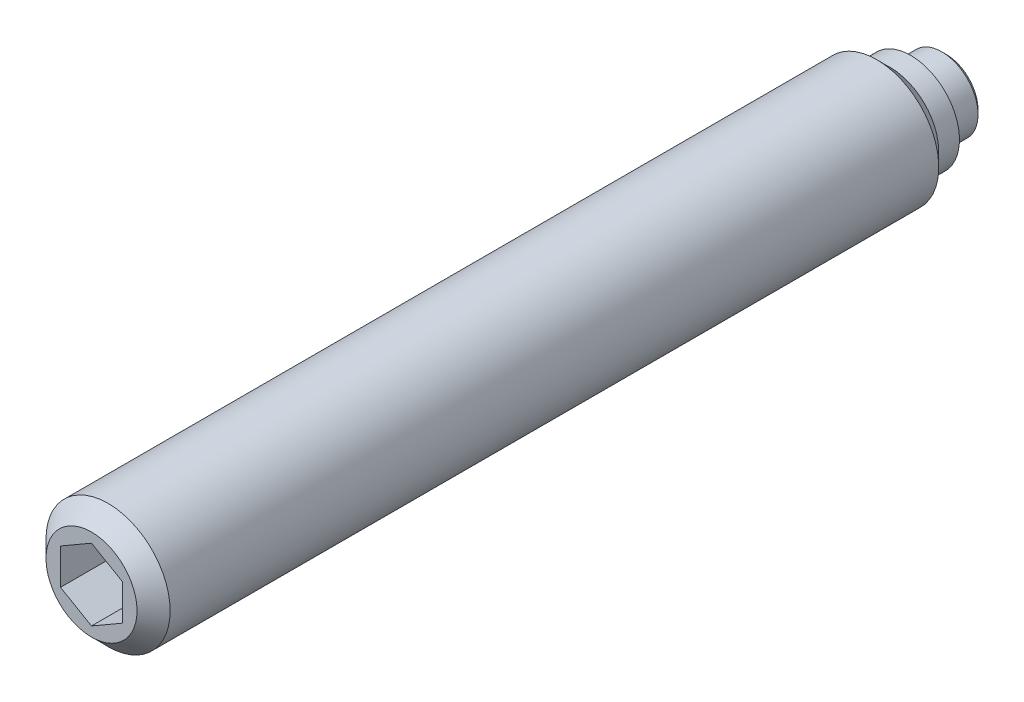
ISO-10303-21;
HEADER;
FILE_DESCRIPTION(('STEP AP214'),'2;1');
FILE_NAME('part.step','',(''),(''),'','','');
FILE_SCHEMA(('AUTOMOTIVE_DESIGN { 1 0 10303 214 1 1 1 1 }'));
ENDSEC;
DATA;
#1=APPLICATION_CONTEXT('core data for automotive mechanical design processes');
#2=APPLICATION_PROTOCOL_DEFINITION('international standard','automotive_design',2000,#1);
#3=PRODUCT_CONTEXT('',#1,'mechanical');
#4=PRODUCT('Part','Part','',(#3));
#5=PRODUCT_RELATED_PRODUCT_CATEGORY('part','',(#4));
#6=PRODUCT_DEFINITION_FORMATION('','',#4);
#7=PRODUCT_DEFINITION_CONTEXT('part definition',#1,'design');
#8=PRODUCT_DEFINITION('design','',#6,#7);
#9=PRODUCT_DEFINITION_SHAPE('','',#8);
#10=(LENGTH_UNIT() NAMED_UNIT(*) SI_UNIT(.MILLI.,.METRE.));
#11=(NAMED_UNIT(*) PLANE_ANGLE_UNIT() SI_UNIT($,.RADIAN.));
#12=(NAMED_UNIT(*) SI_UNIT($,.STERADIAN.) SOLID_ANGLE_UNIT());
#13=UNCERTAINTY_MEASURE_WITH_UNIT(LENGTH_MEASURE(1.E-05),#10,'distance_accuracy_value','');
#14=(GEOMETRIC_REPRESENTATION_CONTEXT(3) GLOBAL_UNCERTAINTY_ASSIGNED_CONTEXT((#13)) GLOBAL_UNIT_ASSIGNED_CONTEXT((#10,
#11,#12)) REPRESENTATION_CONTEXT('',''));
#15=CARTESIAN_POINT('',(0.,0.,0.));
#16=DIRECTION('',(0.,0.,1.));
#17=DIRECTION('',(1.,0.,0.));
#18=AXIS2_PLACEMENT_3D('',#15,#16,#17);
#19=CARTESIAN_POINT('',(0.,0.,0.));
#20=DIRECTION('',(0.,0.,-1.));
#21=DIRECTION('',(-1.,0.,0.));
#22=AXIS2_PLACEMENT_3D('',#19,#20,#21);
#23=CYLINDRICAL_SURFACE('',#22,1.75);
#24=CARTESIAN_POINT('',(0.,0.,0.2));
#25=DIRECTION('',(0.,0.,-1.));
#26=DIRECTION('',(-1.,0.,0.));
#27=AXIS2_PLACEMENT_3D('',#24,#25,#26);
#28=CIRCLE('',#27,1.75);
#29=CARTESIAN_POINT('',(-1.75,0.,0.2));
#30=VERTEX_POINT('',#29);
#31=EDGE_CURVE('E133',#30,#30,#28,.T.);
#32=ORIENTED_EDGE('',*,*,#31,.F.);
#33=EDGE_LOOP('',(#32));
#34=FACE_BOUND('',#33,.T.);
#35=CARTESIAN_POINT('',(0.,0.,1.7));
#36=DIRECTION('',(0.,0.,-1.));
#37=DIRECTION('',(-1.,0.,0.));
#38=AXIS2_PLACEMENT_3D('',#35,#36,#37);
#39=CIRCLE('',#38,1.75);
#40=CARTESIAN_POINT('',(-1.75,0.,1.7));
#41=VERTEX_POINT('',#40);
#42=EDGE_CURVE('E127',#41,#41,#39,.T.);
#43=ORIENTED_EDGE('',*,*,#42,.T.);
#44=EDGE_LOOP('',(#43));
#45=FACE_BOUND('',#44,.T.);
#46=ADVANCED_FACE('F14',(#34,#45),#23,.T.);
#47=CARTESIAN_POINT('',(0.,0.,0.2));
#48=DIRECTION('',(0.,0.,1.));
#49=DIRECTION('',(1.,0.,0.));
#50=AXIS2_PLACEMENT_3D('',#47,#48,#49);
#51=CONICAL_SURFACE('',#50,1.75,0.785398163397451);
#52=CARTESIAN_POINT('',(0.,0.,0.));
#53=DIRECTION('',(0.,0.,-1.));
#54=DIRECTION('',(-1.,0.,0.));
#55=AXIS2_PLACEMENT_3D('',#52,#53,#54);
#56=CIRCLE('',#55,1.55);
#57=CARTESIAN_POINT('',(-1.55,0.,0.));
#58=VERTEX_POINT('',#57);
#59=EDGE_CURVE('E130',#58,#58,#56,.T.);
#60=ORIENTED_EDGE('',*,*,#59,.F.);
#61=EDGE_LOOP('',(#60));
#62=FACE_BOUND('',#61,.T.);
#63=ORIENTED_EDGE('',*,*,#31,.T.);
#64=EDGE_LOOP('',(#63));
#65=FACE_BOUND('',#64,.T.);
#66=ADVANCED_FACE('F159',(#62,#65),#51,.T.);
#67=CARTESIAN_POINT('',(0.,1.55,0.));
#68=DIRECTION('',(0.,0.,1.));
#69=DIRECTION('',(1.,0.,0.));
#70=AXIS2_PLACEMENT_3D('',#67,#68,#69);
#71=PLANE('',#70);
#72=ORIENTED_EDGE('',*,*,#59,.T.);
#73=EDGE_LOOP('',(#72));
#74=FACE_BOUND('',#73,.T.);
#75=ADVANCED_FACE('F165',(#74),#71,.F.);
#76=CARTESIAN_POINT('',(0.,0.,1.7));
#77=DIRECTION('',(0.,0.,-1.));
#78=DIRECTION('',(-1.,0.,0.));
#79=AXIS2_PLACEMENT_3D('',#76,#77,#78);
#80=CYLINDRICAL_SURFACE('',#79,3.);
#81=CARTESIAN_POINT('',(0.,0.,3.35));
#82=DIRECTION('',(0.,0.,-1.));
#83=DIRECTION('',(-1.,0.,0.));
#84=AXIS2_PLACEMENT_3D('',#81,#82,#83);
#85=CIRCLE('',#84,3.);
#86=CARTESIAN_POINT('',(-3.,0.,3.35));
#87=VERTEX_POINT('',#86);
#88=EDGE_CURVE('E9',#87,#87,#85,.T.);
#89=ORIENTED_EDGE('',*,*,#88,.F.);
#90=EDGE_LOOP('',(#89));
#91=FACE_BOUND('',#90,.T.);
#92=CARTESIAN_POINT('',(0.,0.,40.5));
#93=DIRECTION('',(0.,0.,1.));
#94=DIRECTION('',(1.,0.,0.));
#95=AXIS2_PLACEMENT_3D('',#92,#93,#94);
#96=CIRCLE('',#95,3.);
#97=CARTESIAN_POINT('',(3.,0.,40.5));
#98=VERTEX_POINT('',#97);
#99=EDGE_CURVE('E124',#98,#98,#96,.T.);
#100=ORIENTED_EDGE('',*,*,#99,.F.);
#101=EDGE_LOOP('',(#100));
#102=FACE_BOUND('',#101,.T.);
#103=ADVANCED_FACE('F16',(#91,#102),#80,.T.);
#104=CARTESIAN_POINT('',(0.,2.35,1.7));
#105=DIRECTION('',(0.,0.,1.));
#106=DIRECTION('',(1.,0.,0.));
#107=AXIS2_PLACEMENT_3D('',#104,#105,#106);
#108=PLANE('',#107);
#109=CARTESIAN_POINT('',(0.,0.,1.7));
#110=DIRECTION('',(0.,0.,-1.));
#111=DIRECTION('',(-1.,0.,0.));
#112=AXIS2_PLACEMENT_3D('',#109,#110,#111);
#113=CIRCLE('',#112,2.35);
#114=CARTESIAN_POINT('',(-2.35,0.,1.7));
#115=VERTEX_POINT('',#114);
#116=EDGE_CURVE('E136',#115,#115,#113,.T.);
#117=ORIENTED_EDGE('',*,*,#116,.T.);
#118=EDGE_LOOP('',(#117));
#119=FACE_BOUND('',#118,.T.);
#120=ORIENTED_EDGE('',*,*,#42,.F.);
#121=EDGE_LOOP('',(#120));
#122=FACE_BOUND('',#121,.T.);
#123=ADVANCED_FACE('F156',(#119,#122),#108,.F.);
#124=CARTESIAN_POINT('',(0.,0.,1.7));
#125=DIRECTION('',(0.,0.,-1.));
#126=DIRECTION('',(-1.,0.,0.));
#127=AXIS2_PLACEMENT_3D('',#124,#125,#126);
#128=CYLINDRICAL_SURFACE('',#127,2.35);
#129=CARTESIAN_POINT('',(0.,0.,2.7));
#130=DIRECTION('',(0.,0.,-1.));
#131=DIRECTION('',(-1.,0.,0.));
#132=AXIS2_PLACEMENT_3D('',#129,#130,#131);
#133=CIRCLE('',#132,2.35);
#134=CARTESIAN_POINT('',(-2.35,0.,2.7));
#135=VERTEX_POINT('',#134);
#136=EDGE_CURVE('E22',#135,#135,#133,.T.);
#137=ORIENTED_EDGE('',*,*,#136,.T.);
#138=EDGE_LOOP('',(#137));
#139=FACE_BOUND('',#138,.T.);
#140=ORIENTED_EDGE('',*,*,#116,.F.);
#141=EDGE_LOOP('',(#140));
#142=FACE_BOUND('',#141,.T.);
#143=ADVANCED_FACE('F141',(#139,#142),#128,.T.);
#144=CARTESIAN_POINT('',(0.,0.,3.35));
#145=DIRECTION('',(0.,0.,1.));
#146=DIRECTION('',(1.,0.,0.));
#147=AXIS2_PLACEMENT_3D('',#144,#145,#146);
#148=CONICAL_SURFACE('',#147,3.,0.785398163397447);
#149=ORIENTED_EDGE('',*,*,#88,.T.);
#150=EDGE_LOOP('',(#149));
#151=FACE_BOUND('',#150,.T.);
#152=ORIENTED_EDGE('',*,*,#136,.F.);
#153=EDGE_LOOP('',(#152));
#154=FACE_BOUND('',#153,.T.);
#155=ADVANCED_FACE('F144',(#151,#154),#148,.T.);
#156=CARTESIAN_POINT('',(0.,-2.2,41.3));
#157=DIRECTION('',(0.,0.,1.));
#158=DIRECTION('',(1.,0.,0.));
#159=AXIS2_PLACEMENT_3D('',#156,#157,#158);
#160=PLANE('',#159);
#161=DIRECTION('',(0.866025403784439,-0.5,0.));
#162=VECTOR('',#161,1.);
#163=CARTESIAN_POINT('',(-1.5,-0.866025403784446,41.3));
#164=LINE('',#163,#162);
#165=CARTESIAN_POINT('',(-1.5,-0.866025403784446,41.3));
#166=VERTEX_POINT('',#165);
#167=CARTESIAN_POINT('',(0.,-1.73205080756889,41.3));
#168=VERTEX_POINT('',#167);
#169=EDGE_CURVE('E29',#166,#168,#164,.T.);
#170=ORIENTED_EDGE('',*,*,#169,.F.);
#171=DIRECTION('',(0.,-1.,0.));
#172=VECTOR('',#171,1.);
#173=CARTESIAN_POINT('',(-1.5,0.866025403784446,41.3));
#174=LINE('',#173,#172);
#175=CARTESIAN_POINT('',(-1.5,0.866025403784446,41.3));
#176=VERTEX_POINT('',#175);
#177=EDGE_CURVE('E112',#176,#166,#174,.T.);
#178=ORIENTED_EDGE('',*,*,#177,.F.);
#179=DIRECTION('',(-0.866025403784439,-0.5,0.));
#180=VECTOR('',#179,1.);
#181=CARTESIAN_POINT('',(0.,1.73205080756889,41.3));
#182=LINE('',#181,#180);
#183=CARTESIAN_POINT('',(0.,1.73205080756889,41.3));
#184=VERTEX_POINT('',#183);
#185=EDGE_CURVE('E110',#184,#176,#182,.T.);
#186=ORIENTED_EDGE('',*,*,#185,.F.);
#187=DIRECTION('',(-0.866025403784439,0.5,0.));
#188=VECTOR('',#187,1.);
#189=CARTESIAN_POINT('',(1.5,0.866025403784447,41.3));
#190=LINE('',#189,#188);
#191=CARTESIAN_POINT('',(1.5,0.866025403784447,41.3));
#192=VERTEX_POINT('',#191);
#193=EDGE_CURVE('E77',#192,#184,#190,.T.);
#194=ORIENTED_EDGE('',*,*,#193,.F.);
#195=DIRECTION('',(0.,1.,0.));
#196=VECTOR('',#195,1.);
#197=CARTESIAN_POINT('',(1.5,-0.866025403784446,41.3));
#198=LINE('',#197,#196);
#199=CARTESIAN_POINT('',(1.5,-0.866025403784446,41.3));
#200=VERTEX_POINT('',#199);
#201=EDGE_CURVE('E106',#200,#192,#198,.T.);
#202=ORIENTED_EDGE('',*,*,#201,.F.);
#203=DIRECTION('',(0.866025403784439,0.5,0.));
#204=VECTOR('',#203,1.);
#205=CARTESIAN_POINT('',(0.,-1.73205080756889,41.3));
#206=LINE('',#205,#204);
#207=EDGE_CURVE('E103',#168,#200,#206,.T.);
#208=ORIENTED_EDGE('',*,*,#207,.F.);
#209=EDGE_LOOP('',(#170,#178,#186,#194,#202,#208));
#210=FACE_BOUND('',#209,.T.);
#211=CARTESIAN_POINT('',(0.,0.,41.3));
#212=DIRECTION('',(0.,0.,1.));
#213=DIRECTION('',(1.,0.,0.));
#214=AXIS2_PLACEMENT_3D('',#211,#212,#213);
#215=CIRCLE('',#214,2.2);
#216=CARTESIAN_POINT('',(2.2,0.,41.3));
#217=VERTEX_POINT('',#216);
#218=EDGE_CURVE('E116',#217,#217,#215,.T.);
#219=ORIENTED_EDGE('',*,*,#218,.T.);
#220=EDGE_LOOP('',(#219));
#221=FACE_BOUND('',#220,.T.);
#222=ADVANCED_FACE('F146',(#210,#221),#160,.T.);
#223=CARTESIAN_POINT('',(0.,0.,41.3));
#224=DIRECTION('',(0.,0.,-1.));
#225=DIRECTION('',(-1.,0.,0.));
#226=AXIS2_PLACEMENT_3D('',#223,#224,#225);
#227=CONICAL_SURFACE('',#226,2.2,0.785398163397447);
#228=ORIENTED_EDGE('',*,*,#99,.T.);
#229=EDGE_LOOP('',(#228));
#230=FACE_BOUND('',#229,.T.);
#231=ORIENTED_EDGE('',*,*,#218,.F.);
#232=EDGE_LOOP('',(#231));
#233=FACE_BOUND('',#232,.T.);
#234=ADVANCED_FACE('F153',(#230,#233),#227,.T.);
#235=CARTESIAN_POINT('',(-1.5,-0.866025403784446,37.8));
#236=DIRECTION('',(-0.5,-0.866025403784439,0.));
#237=DIRECTION('',(0.866025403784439,-0.5,0.));
#238=AXIS2_PLACEMENT_3D('',#235,#236,#237);
#239=PLANE('',#238);
#240=ORIENTED_EDGE('',*,*,#169,.T.);
#241=DIRECTION('',(0.,0.,1.));
#242=VECTOR('',#241,1.);
#243=CARTESIAN_POINT('',(0.,-1.73205080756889,37.8));
#244=LINE('',#243,#242);
#245=CARTESIAN_POINT('',(0.,-1.73205080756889,37.8));
#246=VERTEX_POINT('',#245);
#247=EDGE_CURVE('E59',#246,#168,#244,.T.);
#248=ORIENTED_EDGE('',*,*,#247,.F.);
#249=DIRECTION('',(0.866025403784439,-0.5,0.));
#250=VECTOR('',#249,1.);
#251=CARTESIAN_POINT('',(-1.5,-0.866025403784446,37.8));
#252=LINE('',#251,#250);
#253=CARTESIAN_POINT('',(-1.5,-0.866025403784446,37.8));
#254=VERTEX_POINT('',#253);
#255=EDGE_CURVE('E114',#254,#246,#252,.T.);
#256=ORIENTED_EDGE('',*,*,#255,.F.);
#257=DIRECTION('',(0.,0.,1.));
#258=VECTOR('',#257,1.);
#259=CARTESIAN_POINT('',(-1.5,-0.866025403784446,37.8));
#260=LINE('',#259,#258);
#261=EDGE_CURVE('E37',#254,#166,#260,.T.);
#262=ORIENTED_EDGE('',*,*,#261,.T.);
#263=EDGE_LOOP('',(#240,#248,#256,#262));
#264=FACE_BOUND('',#263,.T.);
#265=ADVANCED_FACE('F191',(#264),#239,.F.);
#266=CARTESIAN_POINT('',(-1.5,0.866025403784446,37.8));
#267=DIRECTION('',(-1.,0.,0.));
#268=DIRECTION('',(0.,0.,1.));
#269=AXIS2_PLACEMENT_3D('',#266,#267,#268);
#270=PLANE('',#269);
#271=ORIENTED_EDGE('',*,*,#177,.T.);
#272=ORIENTED_EDGE('',*,*,#261,.F.);
#273=DIRECTION('',(0.,-1.,0.));
#274=VECTOR('',#273,1.);
#275=CARTESIAN_POINT('',(-1.5,0.866025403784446,37.8));
#276=LINE('',#275,#274);
#277=CARTESIAN_POINT('',(-1.5,0.866025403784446,37.8));
#278=VERTEX_POINT('',#277);
#279=EDGE_CURVE('E89',#278,#254,#276,.T.);
#280=ORIENTED_EDGE('',*,*,#279,.F.);
#281=DIRECTION('',(0.,0.,1.));
#282=VECTOR('',#281,1.);
#283=CARTESIAN_POINT('',(-1.5,0.866025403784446,37.8));
#284=LINE('',#283,#282);
#285=EDGE_CURVE('E81',#278,#176,#284,.T.);
#286=ORIENTED_EDGE('',*,*,#285,.T.);
#287=EDGE_LOOP('',(#271,#272,#280,#286));
#288=FACE_BOUND('',#287,.T.);
#289=ADVANCED_FACE('F198',(#288),#270,.F.);
#290=CARTESIAN_POINT('',(0.,1.73205080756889,37.8));
#291=DIRECTION('',(-0.5,0.866025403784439,0.));
#292=DIRECTION('',(-0.866025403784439,-0.5,0.));
#293=AXIS2_PLACEMENT_3D('',#290,#291,#292);
#294=PLANE('',#293);
#295=ORIENTED_EDGE('',*,*,#185,.T.);
#296=ORIENTED_EDGE('',*,*,#285,.F.);
#297=DIRECTION('',(-0.866025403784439,-0.5,0.));
#298=VECTOR('',#297,1.);
#299=CARTESIAN_POINT('',(0.,1.73205080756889,37.8));
#300=LINE('',#299,#298);
#301=CARTESIAN_POINT('',(0.,1.73205080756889,37.8));
#302=VERTEX_POINT('',#301);
#303=EDGE_CURVE('E85',#302,#278,#300,.T.);
#304=ORIENTED_EDGE('',*,*,#303,.F.);
#305=DIRECTION('',(0.,0.,1.));
#306=VECTOR('',#305,1.);
#307=CARTESIAN_POINT('',(0.,1.73205080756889,37.8));
#308=LINE('',#307,#306);
#309=EDGE_CURVE('E70',#302,#184,#308,.T.);
#310=ORIENTED_EDGE('',*,*,#309,.T.);
#311=EDGE_LOOP('',(#295,#296,#304,#310));
#312=FACE_BOUND('',#311,.T.);
#313=ADVANCED_FACE('F86',(#312),#294,.F.);
#314=CARTESIAN_POINT('',(1.5,0.866025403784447,37.8));
#315=DIRECTION('',(0.5,0.866025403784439,0.));
#316=DIRECTION('',(-0.866025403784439,0.5,0.));
#317=AXIS2_PLACEMENT_3D('',#314,#315,#316);
#318=PLANE('',#317);
#319=ORIENTED_EDGE('',*,*,#193,.T.);
#320=ORIENTED_EDGE('',*,*,#309,.F.);
#321=DIRECTION('',(-0.866025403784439,0.5,0.));
#322=VECTOR('',#321,1.);
#323=CARTESIAN_POINT('',(1.5,0.866025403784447,37.8));
#324=LINE('',#323,#322);
#325=CARTESIAN_POINT('',(1.5,0.866025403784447,37.8));
#326=VERTEX_POINT('',#325);
#327=EDGE_CURVE('E74',#326,#302,#324,.T.);
#328=ORIENTED_EDGE('',*,*,#327,.F.);
#329=DIRECTION('',(0.,0.,1.));
#330=VECTOR('',#329,1.);
#331=CARTESIAN_POINT('',(1.5,0.866025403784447,37.8));
#332=LINE('',#331,#330);
#333=EDGE_CURVE('E82',#326,#192,#332,.T.);
#334=ORIENTED_EDGE('',*,*,#333,.T.);
#335=EDGE_LOOP('',(#319,#320,#328,#334));
#336=FACE_BOUND('',#335,.T.);
#337=ADVANCED_FACE('F72',(#336),#318,.F.);
#338=CARTESIAN_POINT('',(1.5,-0.866025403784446,37.8));
#339=DIRECTION('',(1.,0.,0.));
#340=DIRECTION('',(0.,1.,0.));
#341=AXIS2_PLACEMENT_3D('',#338,#339,#340);
#342=PLANE('',#341);
#343=ORIENTED_EDGE('',*,*,#201,.T.);
#344=ORIENTED_EDGE('',*,*,#333,.F.);
#345=DIRECTION('',(0.,1.,0.));
#346=VECTOR('',#345,1.);
#347=CARTESIAN_POINT('',(1.5,-0.866025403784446,37.8));
#348=LINE('',#347,#346);
#349=CARTESIAN_POINT('',(1.5,-0.866025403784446,37.8));
#350=VERTEX_POINT('',#349);
#351=EDGE_CURVE('E95',#350,#326,#348,.T.);
#352=ORIENTED_EDGE('',*,*,#351,.F.);
#353=DIRECTION('',(0.,0.,1.));
#354=VECTOR('',#353,1.);
#355=CARTESIAN_POINT('',(1.5,-0.866025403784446,37.8));
#356=LINE('',#355,#354);
#357=EDGE_CURVE('E119',#350,#200,#356,.T.);
#358=ORIENTED_EDGE('',*,*,#357,.T.);
#359=EDGE_LOOP('',(#343,#344,#352,#358));
#360=FACE_BOUND('',#359,.T.);
#361=ADVANCED_FACE('F204',(#360),#342,.F.);
#362=CARTESIAN_POINT('',(0.,-1.73205080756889,37.8));
#363=DIRECTION('',(0.5,-0.866025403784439,0.));
#364=DIRECTION('',(0.866025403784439,0.5,0.));
#365=AXIS2_PLACEMENT_3D('',#362,#363,#364);
#366=PLANE('',#365);
#367=ORIENTED_EDGE('',*,*,#207,.T.);
#368=ORIENTED_EDGE('',*,*,#357,.F.);
#369=DIRECTION('',(0.866025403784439,0.5,0.));
#370=VECTOR('',#369,1.);
#371=CARTESIAN_POINT('',(0.,-1.73205080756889,37.8));
#372=LINE('',#371,#370);
#373=EDGE_CURVE('E97',#246,#350,#372,.T.);
#374=ORIENTED_EDGE('',*,*,#373,.F.);
#375=ORIENTED_EDGE('',*,*,#247,.T.);
#376=EDGE_LOOP('',(#367,#368,#374,#375));
#377=FACE_BOUND('',#376,.T.);
#378=ADVANCED_FACE('F201',(#377),#366,.F.);
#379=CARTESIAN_POINT('',(0.,0.,37.8));
#380=DIRECTION('',(0.,0.,1.));
#381=DIRECTION('',(1.,0.,0.));
#382=AXIS2_PLACEMENT_3D('',#379,#380,#381);
#383=PLANE('',#382);
#384=ORIENTED_EDGE('',*,*,#255,.T.);
#385=ORIENTED_EDGE('',*,*,#373,.T.);
#386=ORIENTED_EDGE('',*,*,#351,.T.);
#387=ORIENTED_EDGE('',*,*,#327,.T.);
#388=ORIENTED_EDGE('',*,*,#303,.T.);
#389=ORIENTED_EDGE('',*,*,#279,.T.);
#390=EDGE_LOOP('',(#384,#385,#386,#387,#388,#389));
#391=FACE_BOUND('',#390,.T.);
#392=ADVANCED_FACE('F92',(#391),#383,.T.);
#393=CLOSED_SHELL('',(#46,#66,#75,#103,#123,#143,#155,#222,#234,#265,#289,#313,#337,#361,#378,#392));
#394=MANIFOLD_SOLID_BREP('B1',#393);
#395=ADVANCED_BREP_SHAPE_REPRESENTATION('',(#18,#394),#14);
#396=SHAPE_DEFINITION_REPRESENTATION(#9,#395);
ENDSEC;
END-ISO-10303-21;
